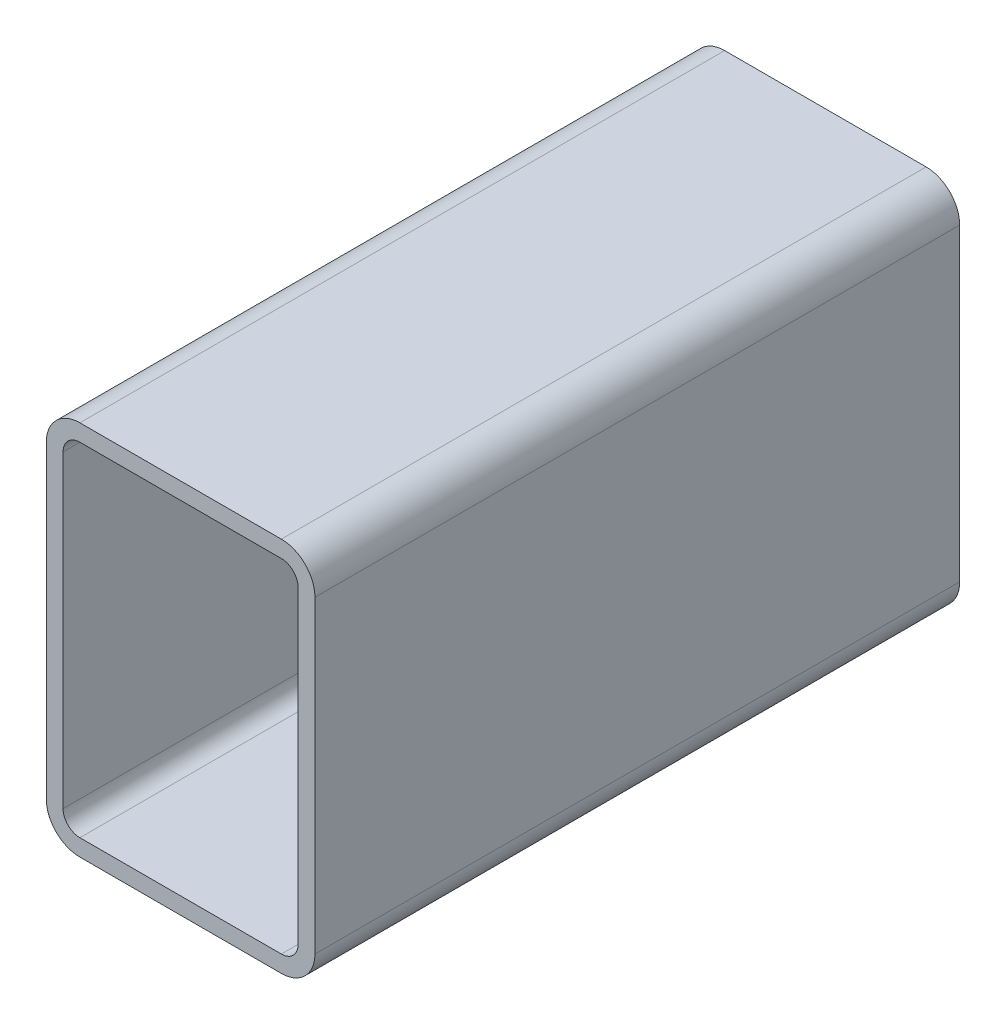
ISO-10303-21;
HEADER;
FILE_DESCRIPTION(('STEP AP214'),'2;1');
FILE_NAME('part.step','',(''),(''),'','','');
FILE_SCHEMA(('AUTOMOTIVE_DESIGN { 1 0 10303 214 1 1 1 1 }'));
ENDSEC;
DATA;
#1=APPLICATION_CONTEXT('core data for automotive mechanical design processes');
#2=APPLICATION_PROTOCOL_DEFINITION('international standard','automotive_design',2000,#1);
#3=PRODUCT_CONTEXT('',#1,'mechanical');
#4=PRODUCT('Part','Part','',(#3));
#5=PRODUCT_RELATED_PRODUCT_CATEGORY('part','',(#4));
#6=PRODUCT_DEFINITION_FORMATION('','',#4);
#7=PRODUCT_DEFINITION_CONTEXT('part definition',#1,'design');
#8=PRODUCT_DEFINITION('design','',#6,#7);
#9=PRODUCT_DEFINITION_SHAPE('','',#8);
#10=(LENGTH_UNIT() NAMED_UNIT(*) SI_UNIT(.MILLI.,.METRE.));
#11=(NAMED_UNIT(*) PLANE_ANGLE_UNIT() SI_UNIT($,.RADIAN.));
#12=(NAMED_UNIT(*) SI_UNIT($,.STERADIAN.) SOLID_ANGLE_UNIT());
#13=UNCERTAINTY_MEASURE_WITH_UNIT(LENGTH_MEASURE(1.E-05),#10,'distance_accuracy_value','');
#14=(GEOMETRIC_REPRESENTATION_CONTEXT(3) GLOBAL_UNCERTAINTY_ASSIGNED_CONTEXT((#13)) GLOBAL_UNIT_ASSIGNED_CONTEXT((#10,
#11,#12)) REPRESENTATION_CONTEXT('',''));
#15=CARTESIAN_POINT('',(0.,0.,0.));
#16=DIRECTION('',(0.,0.,1.));
#17=DIRECTION('',(1.,0.,0.));
#18=AXIS2_PLACEMENT_3D('',#15,#16,#17);
#19=CARTESIAN_POINT('',(16.7362396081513,163.914039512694,304.8));
#20=DIRECTION('',(0.,0.,1.));
#21=DIRECTION('',(1.,0.,0.));
#22=AXIS2_PLACEMENT_3D('',#19,#20,#21);
#23=PLANE('',#22);
#24=CARTESIAN_POINT('',(16.7362396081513,163.914039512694,304.8));
#25=DIRECTION('',(0.,0.,1.));
#26=DIRECTION('',(1.,0.,0.));
#27=AXIS2_PLACEMENT_3D('',#24,#25,#26);
#28=CIRCLE('',#27,15.875);
#29=CARTESIAN_POINT('',(16.7362396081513,179.789039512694,304.8));
#30=VERTEX_POINT('',#29);
#31=CARTESIAN_POINT('',(0.8612396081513,163.914039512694,304.8));
#32=VERTEX_POINT('',#31);
#33=EDGE_CURVE('E211',#30,#32,#28,.T.);
#34=ORIENTED_EDGE('',*,*,#33,.T.);
#35=DIRECTION('',(0.,-1.,0.));
#36=VECTOR('',#35,1.);
#37=CARTESIAN_POINT('',(0.8612396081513,17.8640395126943,304.8));
#38=LINE('',#37,#36);
#39=CARTESIAN_POINT('',(0.8612396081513,17.8640395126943,304.8));
#40=VERTEX_POINT('',#39);
#41=EDGE_CURVE('E214',#32,#40,#38,.T.);
#42=ORIENTED_EDGE('',*,*,#41,.T.);
#43=CARTESIAN_POINT('',(16.7362396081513,17.8640395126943,304.8));
#44=DIRECTION('',(0.,0.,1.));
#45=DIRECTION('',(1.,0.,0.));
#46=AXIS2_PLACEMENT_3D('',#43,#44,#45);
#47=CIRCLE('',#46,15.875);
#48=CARTESIAN_POINT('',(16.7362396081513,1.98903951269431,304.8));
#49=VERTEX_POINT('',#48);
#50=EDGE_CURVE('E217',#40,#49,#47,.T.);
#51=ORIENTED_EDGE('',*,*,#50,.T.);
#52=DIRECTION('',(1.,0.,0.));
#53=VECTOR('',#52,1.);
#54=CARTESIAN_POINT('',(111.986239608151,1.98903951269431,304.8));
#55=LINE('',#54,#53);
#56=CARTESIAN_POINT('',(111.986239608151,1.98903951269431,304.8));
#57=VERTEX_POINT('',#56);
#58=EDGE_CURVE('E219',#49,#57,#55,.T.);
#59=ORIENTED_EDGE('',*,*,#58,.T.);
#60=CARTESIAN_POINT('',(111.986239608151,17.8640395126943,304.8));
#61=DIRECTION('',(0.,0.,1.));
#62=DIRECTION('',(1.,0.,0.));
#63=AXIS2_PLACEMENT_3D('',#60,#61,#62);
#64=CIRCLE('',#63,15.875);
#65=CARTESIAN_POINT('',(127.861239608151,17.8640395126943,304.8));
#66=VERTEX_POINT('',#65);
#67=EDGE_CURVE('E221',#57,#66,#64,.T.);
#68=ORIENTED_EDGE('',*,*,#67,.T.);
#69=DIRECTION('',(0.,1.,0.));
#70=VECTOR('',#69,1.);
#71=CARTESIAN_POINT('',(127.861239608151,163.914039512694,304.8));
#72=LINE('',#71,#70);
#73=CARTESIAN_POINT('',(127.861239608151,163.914039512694,304.8));
#74=VERTEX_POINT('',#73);
#75=EDGE_CURVE('E223',#66,#74,#72,.T.);
#76=ORIENTED_EDGE('',*,*,#75,.T.);
#77=CARTESIAN_POINT('',(111.986239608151,163.914039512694,304.8));
#78=DIRECTION('',(0.,0.,1.));
#79=DIRECTION('',(1.,0.,0.));
#80=AXIS2_PLACEMENT_3D('',#77,#78,#79);
#81=CIRCLE('',#80,15.875);
#82=CARTESIAN_POINT('',(111.986239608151,179.789039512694,304.8));
#83=VERTEX_POINT('',#82);
#84=EDGE_CURVE('E225',#74,#83,#81,.T.);
#85=ORIENTED_EDGE('',*,*,#84,.T.);
#86=DIRECTION('',(-1.,0.,0.));
#87=VECTOR('',#86,1.);
#88=CARTESIAN_POINT('',(16.7362396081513,179.789039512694,304.8));
#89=LINE('',#88,#87);
#90=EDGE_CURVE('E227',#83,#30,#89,.T.);
#91=ORIENTED_EDGE('',*,*,#90,.T.);
#92=EDGE_LOOP('',(#34,#42,#51,#59,#68,#76,#85,#91));
#93=FACE_BOUND('',#92,.T.);
#94=DIRECTION('',(0.,-1.,0.));
#95=VECTOR('',#94,1.);
#96=CARTESIAN_POINT('',(8.7987396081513,17.8640395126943,304.8));
#97=LINE('',#96,#95);
#98=CARTESIAN_POINT('',(8.7987396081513,163.914039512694,304.8));
#99=VERTEX_POINT('',#98);
#100=CARTESIAN_POINT('',(8.7987396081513,17.8640395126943,304.8));
#101=VERTEX_POINT('',#100);
#102=EDGE_CURVE('E154',#99,#101,#97,.T.);
#103=ORIENTED_EDGE('',*,*,#102,.F.);
#104=CARTESIAN_POINT('',(16.7362396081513,163.914039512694,304.8));
#105=DIRECTION('',(0.,0.,1.));
#106=DIRECTION('',(1.,0.,0.));
#107=AXIS2_PLACEMENT_3D('',#104,#105,#106);
#108=CIRCLE('',#107,7.9375);
#109=CARTESIAN_POINT('',(16.7362396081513,171.851539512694,304.8));
#110=VERTEX_POINT('',#109);
#111=EDGE_CURVE('E146',#110,#99,#108,.T.);
#112=ORIENTED_EDGE('',*,*,#111,.F.);
#113=DIRECTION('',(-1.,0.,0.));
#114=VECTOR('',#113,1.);
#115=CARTESIAN_POINT('',(16.7362396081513,171.851539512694,304.8));
#116=LINE('',#115,#114);
#117=CARTESIAN_POINT('',(111.986239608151,171.851539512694,304.8));
#118=VERTEX_POINT('',#117);
#119=EDGE_CURVE('E179',#118,#110,#116,.T.);
#120=ORIENTED_EDGE('',*,*,#119,.F.);
#121=CARTESIAN_POINT('',(111.986239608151,163.914039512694,304.8));
#122=DIRECTION('',(0.,0.,1.));
#123=DIRECTION('',(1.,0.,0.));
#124=AXIS2_PLACEMENT_3D('',#121,#122,#123);
#125=CIRCLE('',#124,7.93750000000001);
#126=CARTESIAN_POINT('',(119.923739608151,163.914039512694,304.8));
#127=VERTEX_POINT('',#126);
#128=EDGE_CURVE('E177',#127,#118,#125,.T.);
#129=ORIENTED_EDGE('',*,*,#128,.F.);
#130=DIRECTION('',(0.,1.,0.));
#131=VECTOR('',#130,1.);
#132=CARTESIAN_POINT('',(119.923739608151,163.914039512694,304.8));
#133=LINE('',#132,#131);
#134=CARTESIAN_POINT('',(119.923739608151,17.8640395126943,304.8));
#135=VERTEX_POINT('',#134);
#136=EDGE_CURVE('E175',#135,#127,#133,.T.);
#137=ORIENTED_EDGE('',*,*,#136,.F.);
#138=CARTESIAN_POINT('',(111.986239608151,17.8640395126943,304.8));
#139=DIRECTION('',(0.,0.,1.));
#140=DIRECTION('',(1.,0.,0.));
#141=AXIS2_PLACEMENT_3D('',#138,#139,#140);
#142=CIRCLE('',#141,7.9375);
#143=CARTESIAN_POINT('',(111.986239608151,9.92653951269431,304.8));
#144=VERTEX_POINT('',#143);
#145=EDGE_CURVE('E173',#144,#135,#142,.T.);
#146=ORIENTED_EDGE('',*,*,#145,.F.);
#147=DIRECTION('',(1.,0.,0.));
#148=VECTOR('',#147,1.);
#149=CARTESIAN_POINT('',(111.986239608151,9.92653951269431,304.8));
#150=LINE('',#149,#148);
#151=CARTESIAN_POINT('',(16.7362396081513,9.92653951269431,304.8));
#152=VERTEX_POINT('',#151);
#153=EDGE_CURVE('E169',#152,#144,#150,.T.);
#154=ORIENTED_EDGE('',*,*,#153,.F.);
#155=CARTESIAN_POINT('',(16.7362396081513,17.8640395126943,304.8));
#156=DIRECTION('',(0.,0.,1.));
#157=DIRECTION('',(1.,0.,0.));
#158=AXIS2_PLACEMENT_3D('',#155,#156,#157);
#159=CIRCLE('',#158,7.9375);
#160=EDGE_CURVE('E167',#101,#152,#159,.T.);
#161=ORIENTED_EDGE('',*,*,#160,.F.);
#162=EDGE_LOOP('',(#103,#112,#120,#129,#137,#146,#154,#161));
#163=FACE_BOUND('',#162,.T.);
#164=ADVANCED_FACE('F33',(#93,#163),#23,.T.);
#165=CARTESIAN_POINT('',(16.7362396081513,163.914039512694,0.));
#166=DIRECTION('',(0.,0.,1.));
#167=DIRECTION('',(1.,0.,0.));
#168=AXIS2_PLACEMENT_3D('',#165,#166,#167);
#169=PLANE('',#168);
#170=CARTESIAN_POINT('',(16.7362396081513,163.914039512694,0.));
#171=DIRECTION('',(0.,0.,1.));
#172=DIRECTION('',(1.,0.,0.));
#173=AXIS2_PLACEMENT_3D('',#170,#171,#172);
#174=CIRCLE('',#173,15.875);
#175=CARTESIAN_POINT('',(16.7362396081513,179.789039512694,0.));
#176=VERTEX_POINT('',#175);
#177=CARTESIAN_POINT('',(0.8612396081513,163.914039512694,0.));
#178=VERTEX_POINT('',#177);
#179=EDGE_CURVE('E162',#176,#178,#174,.T.);
#180=ORIENTED_EDGE('',*,*,#179,.F.);
#181=DIRECTION('',(-1.,0.,0.));
#182=VECTOR('',#181,1.);
#183=CARTESIAN_POINT('',(16.7362396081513,179.789039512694,0.));
#184=LINE('',#183,#182);
#185=CARTESIAN_POINT('',(111.986239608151,179.789039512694,0.));
#186=VERTEX_POINT('',#185);
#187=EDGE_CURVE('E215',#186,#176,#184,.T.);
#188=ORIENTED_EDGE('',*,*,#187,.F.);
#189=CARTESIAN_POINT('',(111.986239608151,163.914039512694,0.));
#190=DIRECTION('',(0.,0.,1.));
#191=DIRECTION('',(1.,0.,0.));
#192=AXIS2_PLACEMENT_3D('',#189,#190,#191);
#193=CIRCLE('',#192,15.875);
#194=CARTESIAN_POINT('',(127.861239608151,163.914039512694,0.));
#195=VERTEX_POINT('',#194);
#196=EDGE_CURVE('E242',#195,#186,#193,.T.);
#197=ORIENTED_EDGE('',*,*,#196,.F.);
#198=DIRECTION('',(0.,1.,0.));
#199=VECTOR('',#198,1.);
#200=CARTESIAN_POINT('',(127.861239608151,163.914039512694,0.));
#201=LINE('',#200,#199);
#202=CARTESIAN_POINT('',(127.861239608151,17.8640395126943,0.));
#203=VERTEX_POINT('',#202);
#204=EDGE_CURVE('E240',#203,#195,#201,.T.);
#205=ORIENTED_EDGE('',*,*,#204,.F.);
#206=CARTESIAN_POINT('',(111.986239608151,17.8640395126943,0.));
#207=DIRECTION('',(0.,0.,1.));
#208=DIRECTION('',(1.,0.,0.));
#209=AXIS2_PLACEMENT_3D('',#206,#207,#208);
#210=CIRCLE('',#209,15.875);
#211=CARTESIAN_POINT('',(111.986239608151,1.98903951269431,0.));
#212=VERTEX_POINT('',#211);
#213=EDGE_CURVE('E238',#212,#203,#210,.T.);
#214=ORIENTED_EDGE('',*,*,#213,.F.);
#215=DIRECTION('',(1.,0.,0.));
#216=VECTOR('',#215,1.);
#217=CARTESIAN_POINT('',(111.986239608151,1.98903951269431,0.));
#218=LINE('',#217,#216);
#219=CARTESIAN_POINT('',(16.7362396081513,1.98903951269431,0.));
#220=VERTEX_POINT('',#219);
#221=EDGE_CURVE('E236',#220,#212,#218,.T.);
#222=ORIENTED_EDGE('',*,*,#221,.F.);
#223=CARTESIAN_POINT('',(16.7362396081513,17.8640395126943,0.));
#224=DIRECTION('',(0.,0.,1.));
#225=DIRECTION('',(1.,0.,0.));
#226=AXIS2_PLACEMENT_3D('',#223,#224,#225);
#227=CIRCLE('',#226,15.875);
#228=CARTESIAN_POINT('',(0.8612396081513,17.8640395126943,0.));
#229=VERTEX_POINT('',#228);
#230=EDGE_CURVE('E234',#229,#220,#227,.T.);
#231=ORIENTED_EDGE('',*,*,#230,.F.);
#232=DIRECTION('',(0.,-1.,0.));
#233=VECTOR('',#232,1.);
#234=CARTESIAN_POINT('',(0.8612396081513,17.8640395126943,0.));
#235=LINE('',#234,#233);
#236=EDGE_CURVE('E232',#178,#229,#235,.T.);
#237=ORIENTED_EDGE('',*,*,#236,.F.);
#238=EDGE_LOOP('',(#180,#188,#197,#205,#214,#222,#231,#237));
#239=FACE_BOUND('',#238,.T.);
#240=CARTESIAN_POINT('',(16.7362396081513,163.914039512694,0.));
#241=DIRECTION('',(0.,0.,1.));
#242=DIRECTION('',(1.,0.,0.));
#243=AXIS2_PLACEMENT_3D('',#240,#241,#242);
#244=CIRCLE('',#243,7.9375);
#245=CARTESIAN_POINT('',(16.7362396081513,171.851539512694,0.));
#246=VERTEX_POINT('',#245);
#247=CARTESIAN_POINT('',(8.7987396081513,163.914039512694,0.));
#248=VERTEX_POINT('',#247);
#249=EDGE_CURVE('E56',#246,#248,#244,.T.);
#250=ORIENTED_EDGE('',*,*,#249,.T.);
#251=DIRECTION('',(0.,-1.,0.));
#252=VECTOR('',#251,1.);
#253=CARTESIAN_POINT('',(8.7987396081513,17.8640395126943,0.));
#254=LINE('',#253,#252);
#255=CARTESIAN_POINT('',(8.7987396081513,17.8640395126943,0.));
#256=VERTEX_POINT('',#255);
#257=EDGE_CURVE('E161',#248,#256,#254,.T.);
#258=ORIENTED_EDGE('',*,*,#257,.T.);
#259=CARTESIAN_POINT('',(16.7362396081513,17.8640395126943,0.));
#260=DIRECTION('',(0.,0.,1.));
#261=DIRECTION('',(1.,0.,0.));
#262=AXIS2_PLACEMENT_3D('',#259,#260,#261);
#263=CIRCLE('',#262,7.9375);
#264=CARTESIAN_POINT('',(16.7362396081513,9.92653951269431,0.));
#265=VERTEX_POINT('',#264);
#266=EDGE_CURVE('E183',#256,#265,#263,.T.);
#267=ORIENTED_EDGE('',*,*,#266,.T.);
#268=DIRECTION('',(1.,0.,0.));
#269=VECTOR('',#268,1.);
#270=CARTESIAN_POINT('',(111.986239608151,9.92653951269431,0.));
#271=LINE('',#270,#269);
#272=CARTESIAN_POINT('',(111.986239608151,9.92653951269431,0.));
#273=VERTEX_POINT('',#272);
#274=EDGE_CURVE('E186',#265,#273,#271,.T.);
#275=ORIENTED_EDGE('',*,*,#274,.T.);
#276=CARTESIAN_POINT('',(111.986239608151,17.8640395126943,0.));
#277=DIRECTION('',(0.,0.,1.));
#278=DIRECTION('',(1.,0.,0.));
#279=AXIS2_PLACEMENT_3D('',#276,#277,#278);
#280=CIRCLE('',#279,7.9375);
#281=CARTESIAN_POINT('',(119.923739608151,17.8640395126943,0.));
#282=VERTEX_POINT('',#281);
#283=EDGE_CURVE('E189',#273,#282,#280,.T.);
#284=ORIENTED_EDGE('',*,*,#283,.T.);
#285=DIRECTION('',(0.,1.,0.));
#286=VECTOR('',#285,1.);
#287=CARTESIAN_POINT('',(119.923739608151,163.914039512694,0.));
#288=LINE('',#287,#286);
#289=CARTESIAN_POINT('',(119.923739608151,163.914039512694,0.));
#290=VERTEX_POINT('',#289);
#291=EDGE_CURVE('E192',#282,#290,#288,.T.);
#292=ORIENTED_EDGE('',*,*,#291,.T.);
#293=CARTESIAN_POINT('',(111.986239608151,163.914039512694,0.));
#294=DIRECTION('',(0.,0.,1.));
#295=DIRECTION('',(1.,0.,0.));
#296=AXIS2_PLACEMENT_3D('',#293,#294,#295);
#297=CIRCLE('',#296,7.93750000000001);
#298=CARTESIAN_POINT('',(111.986239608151,171.851539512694,0.));
#299=VERTEX_POINT('',#298);
#300=EDGE_CURVE('E195',#290,#299,#297,.T.);
#301=ORIENTED_EDGE('',*,*,#300,.T.);
#302=DIRECTION('',(-1.,0.,0.));
#303=VECTOR('',#302,1.);
#304=CARTESIAN_POINT('',(16.7362396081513,171.851539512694,0.));
#305=LINE('',#304,#303);
#306=EDGE_CURVE('E155',#299,#246,#305,.T.);
#307=ORIENTED_EDGE('',*,*,#306,.T.);
#308=EDGE_LOOP('',(#250,#258,#267,#275,#284,#292,#301,#307));
#309=FACE_BOUND('',#308,.T.);
#310=ADVANCED_FACE('F272',(#239,#309),#169,.F.);
#311=CARTESIAN_POINT('',(16.7362396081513,163.914039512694,304.8));
#312=DIRECTION('',(0.,0.,-1.));
#313=DIRECTION('',(-1.,0.,0.));
#314=AXIS2_PLACEMENT_3D('',#311,#312,#313);
#315=CYLINDRICAL_SURFACE('',#314,15.875);
#316=ORIENTED_EDGE('',*,*,#179,.T.);
#317=DIRECTION('',(0.,0.,-1.));
#318=VECTOR('',#317,1.);
#319=CARTESIAN_POINT('',(0.8612396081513,163.914039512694,304.8));
#320=LINE('',#319,#318);
#321=EDGE_CURVE('E11',#32,#178,#320,.T.);
#322=ORIENTED_EDGE('',*,*,#321,.F.);
#323=ORIENTED_EDGE('',*,*,#33,.F.);
#324=DIRECTION('',(0.,0.,-1.));
#325=VECTOR('',#324,1.);
#326=CARTESIAN_POINT('',(16.7362396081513,179.789039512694,304.8));
#327=LINE('',#326,#325);
#328=EDGE_CURVE('E229',#30,#176,#327,.T.);
#329=ORIENTED_EDGE('',*,*,#328,.T.);
#330=EDGE_LOOP('',(#316,#322,#323,#329));
#331=FACE_BOUND('',#330,.T.);
#332=ADVANCED_FACE('F35',(#331),#315,.T.);
#333=CARTESIAN_POINT('',(0.8612396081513,17.8640395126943,304.8));
#334=DIRECTION('',(1.,0.,0.));
#335=DIRECTION('',(0.,0.,-1.));
#336=AXIS2_PLACEMENT_3D('',#333,#334,#335);
#337=PLANE('',#336);
#338=ORIENTED_EDGE('',*,*,#236,.T.);
#339=DIRECTION('',(0.,0.,-1.));
#340=VECTOR('',#339,1.);
#341=CARTESIAN_POINT('',(0.8612396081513,17.8640395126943,304.8));
#342=LINE('',#341,#340);
#343=EDGE_CURVE('E41',#40,#229,#342,.T.);
#344=ORIENTED_EDGE('',*,*,#343,.F.);
#345=ORIENTED_EDGE('',*,*,#41,.F.);
#346=ORIENTED_EDGE('',*,*,#321,.T.);
#347=EDGE_LOOP('',(#338,#344,#345,#346));
#348=FACE_BOUND('',#347,.T.);
#349=ADVANCED_FACE('F289',(#348),#337,.F.);
#350=CARTESIAN_POINT('',(16.7362396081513,17.8640395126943,304.8));
#351=DIRECTION('',(0.,0.,-1.));
#352=DIRECTION('',(-1.,0.,0.));
#353=AXIS2_PLACEMENT_3D('',#350,#351,#352);
#354=CYLINDRICAL_SURFACE('',#353,15.875);
#355=ORIENTED_EDGE('',*,*,#230,.T.);
#356=DIRECTION('',(0.,0.,-1.));
#357=VECTOR('',#356,1.);
#358=CARTESIAN_POINT('',(16.7362396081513,1.98903951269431,304.8));
#359=LINE('',#358,#357);
#360=EDGE_CURVE('E259',#49,#220,#359,.T.);
#361=ORIENTED_EDGE('',*,*,#360,.F.);
#362=ORIENTED_EDGE('',*,*,#50,.F.);
#363=ORIENTED_EDGE('',*,*,#343,.T.);
#364=EDGE_LOOP('',(#355,#361,#362,#363));
#365=FACE_BOUND('',#364,.T.);
#366=ADVANCED_FACE('F266',(#365),#354,.T.);
#367=CARTESIAN_POINT('',(111.986239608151,1.98903951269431,304.8));
#368=DIRECTION('',(0.,1.,0.));
#369=DIRECTION('',(0.,0.,1.));
#370=AXIS2_PLACEMENT_3D('',#367,#368,#369);
#371=PLANE('',#370);
#372=ORIENTED_EDGE('',*,*,#221,.T.);
#373=DIRECTION('',(0.,0.,-1.));
#374=VECTOR('',#373,1.);
#375=CARTESIAN_POINT('',(111.986239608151,1.98903951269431,304.8));
#376=LINE('',#375,#374);
#377=EDGE_CURVE('E256',#57,#212,#376,.T.);
#378=ORIENTED_EDGE('',*,*,#377,.F.);
#379=ORIENTED_EDGE('',*,*,#58,.F.);
#380=ORIENTED_EDGE('',*,*,#360,.T.);
#381=EDGE_LOOP('',(#372,#378,#379,#380));
#382=FACE_BOUND('',#381,.T.);
#383=ADVANCED_FACE('F278',(#382),#371,.F.);
#384=CARTESIAN_POINT('',(111.986239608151,17.8640395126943,304.8));
#385=DIRECTION('',(0.,0.,-1.));
#386=DIRECTION('',(-1.,0.,0.));
#387=AXIS2_PLACEMENT_3D('',#384,#385,#386);
#388=CYLINDRICAL_SURFACE('',#387,15.875);
#389=ORIENTED_EDGE('',*,*,#213,.T.);
#390=DIRECTION('',(0.,0.,-1.));
#391=VECTOR('',#390,1.);
#392=CARTESIAN_POINT('',(127.861239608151,17.8640395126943,304.8));
#393=LINE('',#392,#391);
#394=EDGE_CURVE('E253',#66,#203,#393,.T.);
#395=ORIENTED_EDGE('',*,*,#394,.F.);
#396=ORIENTED_EDGE('',*,*,#67,.F.);
#397=ORIENTED_EDGE('',*,*,#377,.T.);
#398=EDGE_LOOP('',(#389,#395,#396,#397));
#399=FACE_BOUND('',#398,.T.);
#400=ADVANCED_FACE('F282',(#399),#388,.T.);
#401=CARTESIAN_POINT('',(127.861239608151,163.914039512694,304.8));
#402=DIRECTION('',(-1.,0.,0.));
#403=DIRECTION('',(0.,0.,1.));
#404=AXIS2_PLACEMENT_3D('',#401,#402,#403);
#405=PLANE('',#404);
#406=ORIENTED_EDGE('',*,*,#204,.T.);
#407=DIRECTION('',(0.,0.,-1.));
#408=VECTOR('',#407,1.);
#409=CARTESIAN_POINT('',(127.861239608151,163.914039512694,304.8));
#410=LINE('',#409,#408);
#411=EDGE_CURVE('E250',#74,#195,#410,.T.);
#412=ORIENTED_EDGE('',*,*,#411,.F.);
#413=ORIENTED_EDGE('',*,*,#75,.F.);
#414=ORIENTED_EDGE('',*,*,#394,.T.);
#415=EDGE_LOOP('',(#406,#412,#413,#414));
#416=FACE_BOUND('',#415,.T.);
#417=ADVANCED_FACE('F302',(#416),#405,.F.);
#418=CARTESIAN_POINT('',(111.986239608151,163.914039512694,304.8));
#419=DIRECTION('',(0.,0.,-1.));
#420=DIRECTION('',(-1.,0.,0.));
#421=AXIS2_PLACEMENT_3D('',#418,#419,#420);
#422=CYLINDRICAL_SURFACE('',#421,15.875);
#423=ORIENTED_EDGE('',*,*,#196,.T.);
#424=DIRECTION('',(0.,0.,-1.));
#425=VECTOR('',#424,1.);
#426=CARTESIAN_POINT('',(111.986239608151,179.789039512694,304.8));
#427=LINE('',#426,#425);
#428=EDGE_CURVE('E247',#83,#186,#427,.T.);
#429=ORIENTED_EDGE('',*,*,#428,.F.);
#430=ORIENTED_EDGE('',*,*,#84,.F.);
#431=ORIENTED_EDGE('',*,*,#411,.T.);
#432=EDGE_LOOP('',(#423,#429,#430,#431));
#433=FACE_BOUND('',#432,.T.);
#434=ADVANCED_FACE('F300',(#433),#422,.T.);
#435=CARTESIAN_POINT('',(16.7362396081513,179.789039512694,304.8));
#436=DIRECTION('',(0.,-1.,0.));
#437=DIRECTION('',(0.,0.,-1.));
#438=AXIS2_PLACEMENT_3D('',#435,#436,#437);
#439=PLANE('',#438);
#440=ORIENTED_EDGE('',*,*,#187,.T.);
#441=ORIENTED_EDGE('',*,*,#328,.F.);
#442=ORIENTED_EDGE('',*,*,#90,.F.);
#443=ORIENTED_EDGE('',*,*,#428,.T.);
#444=EDGE_LOOP('',(#440,#441,#442,#443));
#445=FACE_BOUND('',#444,.T.);
#446=ADVANCED_FACE('F295',(#445),#439,.F.);
#447=CARTESIAN_POINT('',(16.7362396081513,163.914039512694,304.8));
#448=DIRECTION('',(0.,0.,-1.));
#449=DIRECTION('',(-1.,0.,0.));
#450=AXIS2_PLACEMENT_3D('',#447,#448,#449);
#451=CYLINDRICAL_SURFACE('',#450,7.9375);
#452=ORIENTED_EDGE('',*,*,#249,.F.);
#453=DIRECTION('',(0.,0.,-1.));
#454=VECTOR('',#453,1.);
#455=CARTESIAN_POINT('',(16.7362396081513,171.851539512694,304.8));
#456=LINE('',#455,#454);
#457=EDGE_CURVE('E150',#110,#246,#456,.T.);
#458=ORIENTED_EDGE('',*,*,#457,.F.);
#459=ORIENTED_EDGE('',*,*,#111,.T.);
#460=DIRECTION('',(0.,0.,-1.));
#461=VECTOR('',#460,1.);
#462=CARTESIAN_POINT('',(8.7987396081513,163.914039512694,304.8));
#463=LINE('',#462,#461);
#464=EDGE_CURVE('E149',#99,#248,#463,.T.);
#465=ORIENTED_EDGE('',*,*,#464,.T.);
#466=EDGE_LOOP('',(#452,#458,#459,#465));
#467=FACE_BOUND('',#466,.T.);
#468=ADVANCED_FACE('F148',(#467),#451,.F.);
#469=CARTESIAN_POINT('',(8.7987396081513,17.8640395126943,304.8));
#470=DIRECTION('',(1.,0.,0.));
#471=DIRECTION('',(0.,0.,-1.));
#472=AXIS2_PLACEMENT_3D('',#469,#470,#471);
#473=PLANE('',#472);
#474=ORIENTED_EDGE('',*,*,#257,.F.);
#475=ORIENTED_EDGE('',*,*,#464,.F.);
#476=ORIENTED_EDGE('',*,*,#102,.T.);
#477=DIRECTION('',(0.,0.,-1.));
#478=VECTOR('',#477,1.);
#479=CARTESIAN_POINT('',(8.7987396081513,17.8640395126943,304.8));
#480=LINE('',#479,#478);
#481=EDGE_CURVE('E163',#101,#256,#480,.T.);
#482=ORIENTED_EDGE('',*,*,#481,.T.);
#483=EDGE_LOOP('',(#474,#475,#476,#482));
#484=FACE_BOUND('',#483,.T.);
#485=ADVANCED_FACE('F158',(#484),#473,.T.);
#486=CARTESIAN_POINT('',(16.7362396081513,17.8640395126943,304.8));
#487=DIRECTION('',(0.,0.,-1.));
#488=DIRECTION('',(-1.,0.,0.));
#489=AXIS2_PLACEMENT_3D('',#486,#487,#488);
#490=CYLINDRICAL_SURFACE('',#489,7.9375);
#491=ORIENTED_EDGE('',*,*,#266,.F.);
#492=ORIENTED_EDGE('',*,*,#481,.F.);
#493=ORIENTED_EDGE('',*,*,#160,.T.);
#494=DIRECTION('',(0.,0.,-1.));
#495=VECTOR('',#494,1.);
#496=CARTESIAN_POINT('',(16.7362396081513,9.92653951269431,304.8));
#497=LINE('',#496,#495);
#498=EDGE_CURVE('E208',#152,#265,#497,.T.);
#499=ORIENTED_EDGE('',*,*,#498,.T.);
#500=EDGE_LOOP('',(#491,#492,#493,#499));
#501=FACE_BOUND('',#500,.T.);
#502=ADVANCED_FACE('F327',(#501),#490,.F.);
#503=CARTESIAN_POINT('',(111.986239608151,9.92653951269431,304.8));
#504=DIRECTION('',(0.,1.,0.));
#505=DIRECTION('',(0.,0.,1.));
#506=AXIS2_PLACEMENT_3D('',#503,#504,#505);
#507=PLANE('',#506);
#508=ORIENTED_EDGE('',*,*,#274,.F.);
#509=ORIENTED_EDGE('',*,*,#498,.F.);
#510=ORIENTED_EDGE('',*,*,#153,.T.);
#511=DIRECTION('',(0.,0.,-1.));
#512=VECTOR('',#511,1.);
#513=CARTESIAN_POINT('',(111.986239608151,9.92653951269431,304.8));
#514=LINE('',#513,#512);
#515=EDGE_CURVE('E206',#144,#273,#514,.T.);
#516=ORIENTED_EDGE('',*,*,#515,.T.);
#517=EDGE_LOOP('',(#508,#509,#510,#516));
#518=FACE_BOUND('',#517,.T.);
#519=ADVANCED_FACE('F331',(#518),#507,.T.);
#520=CARTESIAN_POINT('',(111.986239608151,17.8640395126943,304.8));
#521=DIRECTION('',(0.,0.,-1.));
#522=DIRECTION('',(-1.,0.,0.));
#523=AXIS2_PLACEMENT_3D('',#520,#521,#522);
#524=CYLINDRICAL_SURFACE('',#523,7.9375);
#525=ORIENTED_EDGE('',*,*,#283,.F.);
#526=ORIENTED_EDGE('',*,*,#515,.F.);
#527=ORIENTED_EDGE('',*,*,#145,.T.);
#528=DIRECTION('',(0.,0.,-1.));
#529=VECTOR('',#528,1.);
#530=CARTESIAN_POINT('',(119.923739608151,17.8640395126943,304.8));
#531=LINE('',#530,#529);
#532=EDGE_CURVE('E204',#135,#282,#531,.T.);
#533=ORIENTED_EDGE('',*,*,#532,.T.);
#534=EDGE_LOOP('',(#525,#526,#527,#533));
#535=FACE_BOUND('',#534,.T.);
#536=ADVANCED_FACE('F337',(#535),#524,.F.);
#537=CARTESIAN_POINT('',(119.923739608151,163.914039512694,304.8));
#538=DIRECTION('',(-1.,0.,0.));
#539=DIRECTION('',(0.,0.,1.));
#540=AXIS2_PLACEMENT_3D('',#537,#538,#539);
#541=PLANE('',#540);
#542=ORIENTED_EDGE('',*,*,#291,.F.);
#543=ORIENTED_EDGE('',*,*,#532,.F.);
#544=ORIENTED_EDGE('',*,*,#136,.T.);
#545=DIRECTION('',(0.,0.,-1.));
#546=VECTOR('',#545,1.);
#547=CARTESIAN_POINT('',(119.923739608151,163.914039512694,304.8));
#548=LINE('',#547,#546);
#549=EDGE_CURVE('E202',#127,#290,#548,.T.);
#550=ORIENTED_EDGE('',*,*,#549,.T.);
#551=EDGE_LOOP('',(#542,#543,#544,#550));
#552=FACE_BOUND('',#551,.T.);
#553=ADVANCED_FACE('F341',(#552),#541,.T.);
#554=CARTESIAN_POINT('',(111.986239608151,163.914039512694,304.8));
#555=DIRECTION('',(0.,0.,-1.));
#556=DIRECTION('',(-1.,0.,0.));
#557=AXIS2_PLACEMENT_3D('',#554,#555,#556);
#558=CYLINDRICAL_SURFACE('',#557,7.93750000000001);
#559=ORIENTED_EDGE('',*,*,#300,.F.);
#560=ORIENTED_EDGE('',*,*,#549,.F.);
#561=ORIENTED_EDGE('',*,*,#128,.T.);
#562=DIRECTION('',(0.,0.,-1.));
#563=VECTOR('',#562,1.);
#564=CARTESIAN_POINT('',(111.986239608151,171.851539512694,304.8));
#565=LINE('',#564,#563);
#566=EDGE_CURVE('E48',#118,#299,#565,.T.);
#567=ORIENTED_EDGE('',*,*,#566,.T.);
#568=EDGE_LOOP('',(#559,#560,#561,#567));
#569=FACE_BOUND('',#568,.T.);
#570=ADVANCED_FACE('F345',(#569),#558,.F.);
#571=CARTESIAN_POINT('',(16.7362396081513,171.851539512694,304.8));
#572=DIRECTION('',(0.,-1.,0.));
#573=DIRECTION('',(0.,0.,-1.));
#574=AXIS2_PLACEMENT_3D('',#571,#572,#573);
#575=PLANE('',#574);
#576=ORIENTED_EDGE('',*,*,#306,.F.);
#577=ORIENTED_EDGE('',*,*,#566,.F.);
#578=ORIENTED_EDGE('',*,*,#119,.T.);
#579=ORIENTED_EDGE('',*,*,#457,.T.);
#580=EDGE_LOOP('',(#576,#577,#578,#579));
#581=FACE_BOUND('',#580,.T.);
#582=ADVANCED_FACE('F349',(#581),#575,.T.);
#583=CLOSED_SHELL('',(#164,#310,#332,#349,#366,#383,#400,#417,#434,#446,#468,#485,#502,#519,
#536,#553,#570,#582));
#584=MANIFOLD_SOLID_BREP('B2',#583);
#585=ADVANCED_BREP_SHAPE_REPRESENTATION('',(#18,#584),#14);
#586=SHAPE_DEFINITION_REPRESENTATION(#9,#585);
ENDSEC;
END-ISO-10303-21;
